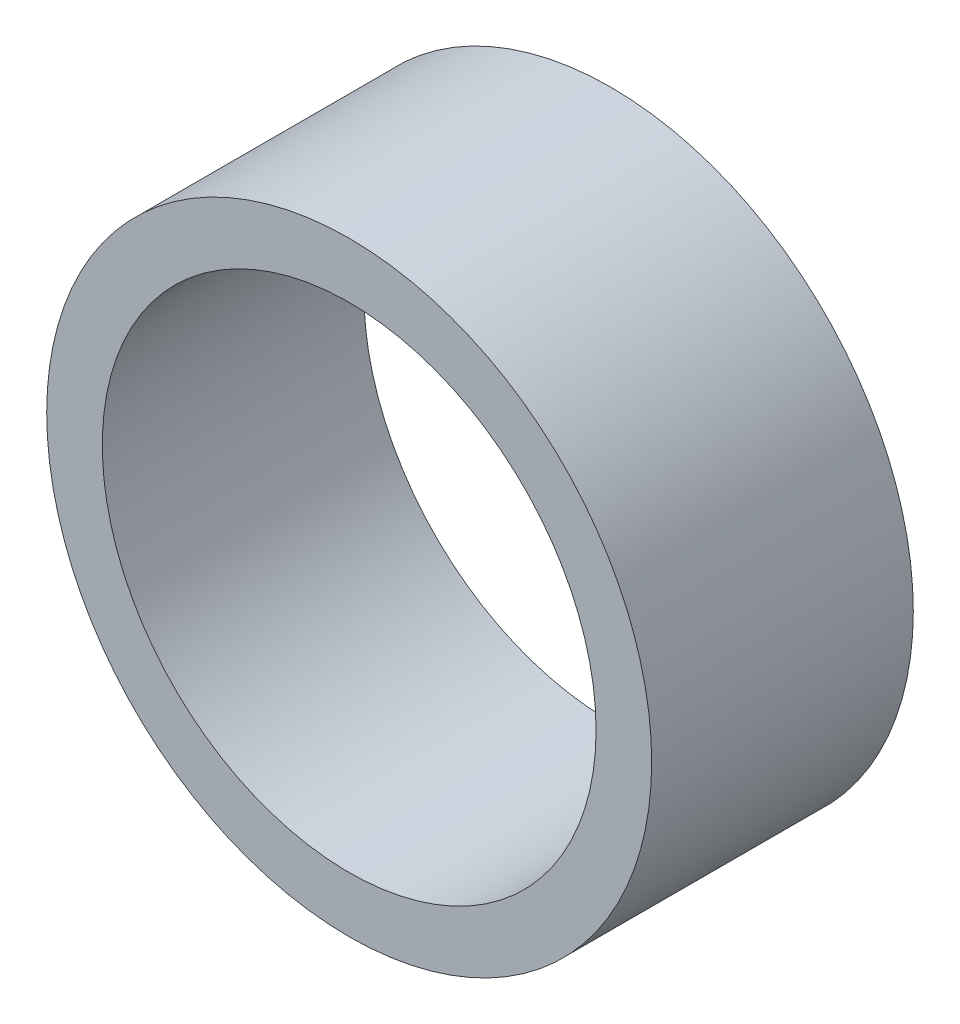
ISO-10303-21;
HEADER;
FILE_DESCRIPTION(('STEP AP214'),'2;1');
FILE_NAME('part.step','',(''),(''),'','','');
FILE_SCHEMA(('AUTOMOTIVE_DESIGN { 1 0 10303 214 1 1 1 1 }'));
ENDSEC;
DATA;
#1=APPLICATION_CONTEXT('core data for automotive mechanical design processes');
#2=APPLICATION_PROTOCOL_DEFINITION('international standard','automotive_design',2000,#1);
#3=PRODUCT_CONTEXT('',#1,'mechanical');
#4=PRODUCT('Part','Part','',(#3));
#5=PRODUCT_RELATED_PRODUCT_CATEGORY('part','',(#4));
#6=PRODUCT_DEFINITION_FORMATION('','',#4);
#7=PRODUCT_DEFINITION_CONTEXT('part definition',#1,'design');
#8=PRODUCT_DEFINITION('design','',#6,#7);
#9=PRODUCT_DEFINITION_SHAPE('','',#8);
#10=(LENGTH_UNIT() NAMED_UNIT(*) SI_UNIT(.MILLI.,.METRE.));
#11=(NAMED_UNIT(*) PLANE_ANGLE_UNIT() SI_UNIT($,.RADIAN.));
#12=(NAMED_UNIT(*) SI_UNIT($,.STERADIAN.) SOLID_ANGLE_UNIT());
#13=UNCERTAINTY_MEASURE_WITH_UNIT(LENGTH_MEASURE(1.E-05),#10,'distance_accuracy_value','');
#14=(GEOMETRIC_REPRESENTATION_CONTEXT(3) GLOBAL_UNCERTAINTY_ASSIGNED_CONTEXT((#13)) GLOBAL_UNIT_ASSIGNED_CONTEXT((#10,
#11,#12)) REPRESENTATION_CONTEXT('',''));
#15=CARTESIAN_POINT('',(0.,0.,0.));
#16=DIRECTION('',(0.,0.,1.));
#17=DIRECTION('',(1.,0.,0.));
#18=AXIS2_PLACEMENT_3D('',#15,#16,#17);
#19=CARTESIAN_POINT('',(0.,0.,16.));
#20=DIRECTION('',(0.,0.,1.));
#21=DIRECTION('',(1.,0.,0.));
#22=AXIS2_PLACEMENT_3D('',#19,#20,#21);
#23=PLANE('',#22);
#24=CARTESIAN_POINT('',(0.,0.,16.));
#25=DIRECTION('',(0.,0.,1.));
#26=DIRECTION('',(1.,0.,0.));
#27=AXIS2_PLACEMENT_3D('',#24,#25,#26);
#28=CIRCLE('',#27,18.5);
#29=CARTESIAN_POINT('',(18.5,0.,16.));
#30=VERTEX_POINT('',#29);
#31=EDGE_CURVE('E10',#30,#30,#28,.T.);
#32=ORIENTED_EDGE('',*,*,#31,.T.);
#33=EDGE_LOOP('',(#32));
#34=FACE_BOUND('',#33,.T.);
#35=CARTESIAN_POINT('',(0.,0.,16.));
#36=DIRECTION('',(0.,0.,1.));
#37=DIRECTION('',(1.,0.,0.));
#38=AXIS2_PLACEMENT_3D('',#35,#36,#37);
#39=CIRCLE('',#38,15.1);
#40=CARTESIAN_POINT('',(15.1,0.,16.));
#41=VERTEX_POINT('',#40);
#42=EDGE_CURVE('E41',#41,#41,#39,.T.);
#43=ORIENTED_EDGE('',*,*,#42,.F.);
#44=EDGE_LOOP('',(#43));
#45=FACE_BOUND('',#44,.T.);
#46=ADVANCED_FACE('F30',(#34,#45),#23,.T.);
#47=CARTESIAN_POINT('',(0.,0.,0.));
#48=DIRECTION('',(0.,0.,1.));
#49=DIRECTION('',(1.,0.,0.));
#50=AXIS2_PLACEMENT_3D('',#47,#48,#49);
#51=PLANE('',#50);
#52=CARTESIAN_POINT('',(0.,0.,0.));
#53=DIRECTION('',(0.,0.,1.));
#54=DIRECTION('',(1.,0.,0.));
#55=AXIS2_PLACEMENT_3D('',#52,#53,#54);
#56=CIRCLE('',#55,18.5);
#57=CARTESIAN_POINT('',(18.5,0.,0.));
#58=VERTEX_POINT('',#57);
#59=EDGE_CURVE('E37',#58,#58,#56,.T.);
#60=ORIENTED_EDGE('',*,*,#59,.F.);
#61=EDGE_LOOP('',(#60));
#62=FACE_BOUND('',#61,.T.);
#63=CARTESIAN_POINT('',(0.,0.,0.));
#64=DIRECTION('',(0.,0.,1.));
#65=DIRECTION('',(1.,0.,0.));
#66=AXIS2_PLACEMENT_3D('',#63,#64,#65);
#67=CIRCLE('',#66,15.1);
#68=CARTESIAN_POINT('',(15.1,0.,0.));
#69=VERTEX_POINT('',#68);
#70=EDGE_CURVE('E45',#69,#69,#67,.T.);
#71=ORIENTED_EDGE('',*,*,#70,.T.);
#72=EDGE_LOOP('',(#71));
#73=FACE_BOUND('',#72,.T.);
#74=ADVANCED_FACE('F51',(#62,#73),#51,.F.);
#75=CARTESIAN_POINT('',(0.,0.,16.));
#76=DIRECTION('',(0.,0.,-1.));
#77=DIRECTION('',(-1.,0.,0.));
#78=AXIS2_PLACEMENT_3D('',#75,#76,#77);
#79=CYLINDRICAL_SURFACE('',#78,18.5);
#80=ORIENTED_EDGE('',*,*,#31,.F.);
#81=EDGE_LOOP('',(#80));
#82=FACE_BOUND('',#81,.T.);
#83=ORIENTED_EDGE('',*,*,#59,.T.);
#84=EDGE_LOOP('',(#83));
#85=FACE_BOUND('',#84,.T.);
#86=ADVANCED_FACE('F32',(#82,#85),#79,.T.);
#87=CARTESIAN_POINT('',(0.,0.,16.));
#88=DIRECTION('',(0.,0.,-1.));
#89=DIRECTION('',(-1.,0.,0.));
#90=AXIS2_PLACEMENT_3D('',#87,#88,#89);
#91=CYLINDRICAL_SURFACE('',#90,15.1);
#92=ORIENTED_EDGE('',*,*,#42,.T.);
#93=EDGE_LOOP('',(#92));
#94=FACE_BOUND('',#93,.T.);
#95=ORIENTED_EDGE('',*,*,#70,.F.);
#96=EDGE_LOOP('',(#95));
#97=FACE_BOUND('',#96,.T.);
#98=ADVANCED_FACE('F53',(#94,#97),#91,.F.);
#99=CLOSED_SHELL('',(#46,#74,#86,#98));
#100=MANIFOLD_SOLID_BREP('B2',#99);
#101=ADVANCED_BREP_SHAPE_REPRESENTATION('',(#18,#100),#14);
#102=SHAPE_DEFINITION_REPRESENTATION(#9,#101);
ENDSEC;
END-ISO-10303-21;
